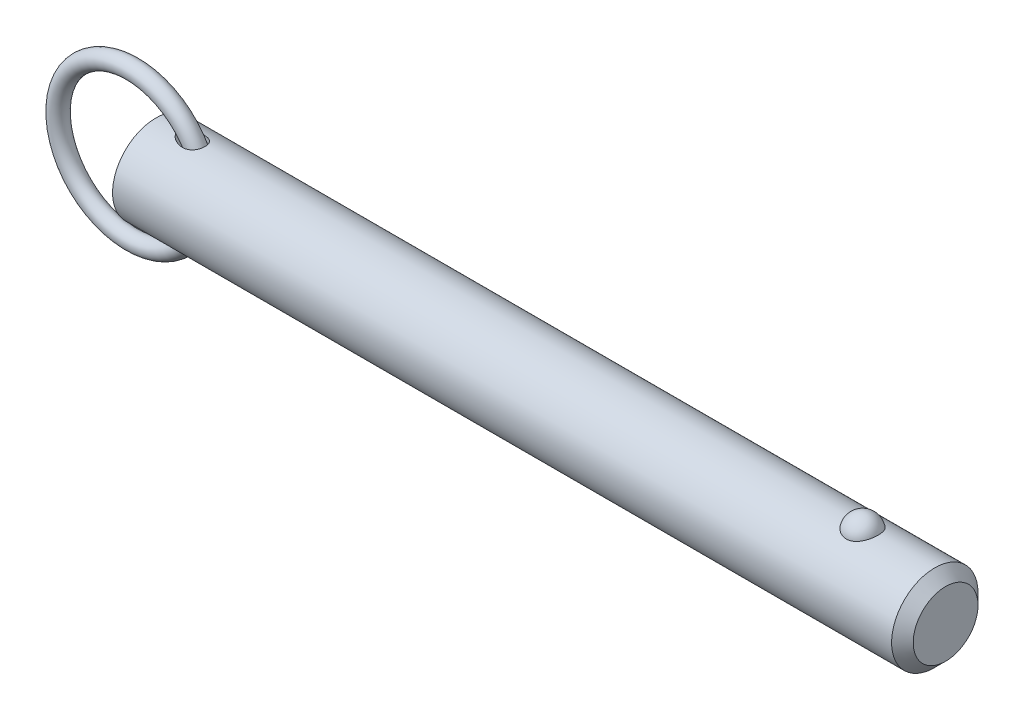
ISO-10303-21;
HEADER;
FILE_DESCRIPTION(('STEP AP214'),'2;1');
FILE_NAME('part.step','',(''),(''),'','','');
FILE_SCHEMA(('AUTOMOTIVE_DESIGN { 1 0 10303 214 1 1 1 1 }'));
ENDSEC;
DATA;
#1=APPLICATION_CONTEXT('core data for automotive mechanical design processes');
#2=APPLICATION_PROTOCOL_DEFINITION('international standard','automotive_design',2000,#1);
#3=PRODUCT_CONTEXT('',#1,'mechanical');
#4=PRODUCT('Part','Part','',(#3));
#5=PRODUCT_RELATED_PRODUCT_CATEGORY('part','',(#4));
#6=PRODUCT_DEFINITION_FORMATION('','',#4);
#7=PRODUCT_DEFINITION_CONTEXT('part definition',#1,'design');
#8=PRODUCT_DEFINITION('design','',#6,#7);
#9=PRODUCT_DEFINITION_SHAPE('','',#8);
#10=(LENGTH_UNIT() NAMED_UNIT(*) SI_UNIT(.MILLI.,.METRE.));
#11=(NAMED_UNIT(*) PLANE_ANGLE_UNIT() SI_UNIT($,.RADIAN.));
#12=(NAMED_UNIT(*) SI_UNIT($,.STERADIAN.) SOLID_ANGLE_UNIT());
#13=UNCERTAINTY_MEASURE_WITH_UNIT(LENGTH_MEASURE(1.E-05),#10,'distance_accuracy_value','');
#14=(GEOMETRIC_REPRESENTATION_CONTEXT(3) GLOBAL_UNCERTAINTY_ASSIGNED_CONTEXT((#13)) GLOBAL_UNIT_ASSIGNED_CONTEXT((#10,
#11,#12)) REPRESENTATION_CONTEXT('',''));
#15=CARTESIAN_POINT('',(0.,0.,0.));
#16=DIRECTION('',(0.,0.,1.));
#17=DIRECTION('',(1.,0.,0.));
#18=AXIS2_PLACEMENT_3D('',#15,#16,#17);
#19=CARTESIAN_POINT('',(-6.08699288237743,0.,0.));
#20=DIRECTION('',(0.,0.,1.));
#21=DIRECTION('',(1.,0.,0.));
#22=AXIS2_PLACEMENT_3D('',#19,#20,#21);
#23=TOROIDAL_SURFACE('',#22,19.05,2.223);
#24=CARTESIAN_POINT('',(15.1860071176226,0.,0.));
#25=VERTEX_POINT('',#24);
#26=VERTEX_LOOP('',#25);
#27=FACE_BOUND('',#26,.T.);
#28=ADVANCED_FACE('P0_F12',(#27),#23,.T.);
#29=CLOSED_SHELL('',(#28));
#30=MANIFOLD_SOLID_BREP('P0_B1',#29);
#31=CARTESIAN_POINT('',(0.,0.,0.));
#32=DIRECTION('',(1.,0.,0.));
#33=DIRECTION('',(0.,0.,-1.));
#34=AXIS2_PLACEMENT_3D('',#31,#32,#33);
#35=CYLINDRICAL_SURFACE('',#34,11.115);
#36=CARTESIAN_POINT('',(6.41405181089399,11.0227946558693,-1.4287136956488));
#37=CARTESIAN_POINT('',(6.49338916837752,11.0115377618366,-1.51556642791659));
#38=CARTESIAN_POINT('',(6.57765461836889,10.9998263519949,-1.59789397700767));
#39=CARTESIAN_POINT('',(6.75386647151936,10.9760304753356,-1.75391400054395));
#40=CARTESIAN_POINT('',(6.84582247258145,10.9639455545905,-1.82759540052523));
#41=CARTESIAN_POINT('',(7.03627827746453,10.9397989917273,-1.96698954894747));
#42=CARTESIAN_POINT('',(7.1348083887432,10.9277377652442,-2.03266078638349));
#43=CARTESIAN_POINT('',(7.33681032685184,10.9041015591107,-2.1558582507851));
#44=CARTESIAN_POINT('',(7.44028007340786,10.8925263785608,-2.21338786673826));
#45=CARTESIAN_POINT('',(7.64386117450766,10.8710104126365,-2.31666528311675));
#46=CARTESIAN_POINT('',(7.74368989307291,10.8610119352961,-2.36295942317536));
#47=CARTESIAN_POINT('',(7.94637195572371,10.8420168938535,-2.44863486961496));
#48=CARTESIAN_POINT('',(8.0492261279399,10.8330206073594,-2.48801426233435));
#49=CARTESIAN_POINT('',(8.36115573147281,10.807980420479,-2.59542730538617));
#50=CARTESIAN_POINT('',(8.57411849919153,10.7938278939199,-2.65299817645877));
#51=CARTESIAN_POINT('',(9.00825016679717,10.7725818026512,-2.73800108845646));
#52=CARTESIAN_POINT('',(9.22947335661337,10.7655491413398,-2.76517330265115));
#53=CARTESIAN_POINT('',(9.6736814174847,10.7605872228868,-2.78445308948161));
#54=CARTESIAN_POINT('',(9.89666486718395,10.7626512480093,-2.77658653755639));
#55=CARTESIAN_POINT('',(10.2950172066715,10.7754452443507,-2.72644436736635));
#56=CARTESIAN_POINT('',(10.4712789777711,10.7844280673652,-2.69109376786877));
#57=CARTESIAN_POINT('',(10.7292776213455,10.8024982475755,-2.61722365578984));
#58=CARTESIAN_POINT('',(10.8142337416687,10.8092901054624,-2.58911576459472));
#59=CARTESIAN_POINT('',(10.9813218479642,10.8242580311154,-2.52581287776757));
#60=CARTESIAN_POINT('',(11.0634550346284,10.8324335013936,-2.49062094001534));
#61=CARTESIAN_POINT('',(11.2247418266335,10.8500287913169,-2.41281958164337));
#62=CARTESIAN_POINT('',(11.3038694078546,10.8594572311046,-2.37015806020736));
#63=CARTESIAN_POINT('',(11.4576781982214,10.8792243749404,-2.27770403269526));
#64=CARTESIAN_POINT('',(11.5323615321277,10.8895626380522,-2.22791497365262));
#65=CARTESIAN_POINT('',(11.6765388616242,10.9108113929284,-2.12140590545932));
#66=CARTESIAN_POINT('',(11.7460329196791,10.9217218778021,-2.064685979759));
#67=CARTESIAN_POINT('',(11.8790597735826,10.9437207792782,-1.94471764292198));
#68=CARTESIAN_POINT('',(11.9425932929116,10.9548091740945,-1.88147002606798));
#69=CARTESIAN_POINT('',(12.109388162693,10.9851999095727,-1.69784918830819));
#70=CARTESIAN_POINT('',(12.205655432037,11.0042655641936,-1.57093023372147));
#71=CARTESIAN_POINT('',(12.374151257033,11.0393391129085,-1.3017676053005));
#72=CARTESIAN_POINT('',(12.4463875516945,11.0553479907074,-1.15952888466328));
#73=CARTESIAN_POINT('',(12.5615818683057,11.0816338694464,-0.871972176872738));
#74=CARTESIAN_POINT('',(12.6058896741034,11.0921698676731,-0.727217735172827));
#75=CARTESIAN_POINT('',(12.6699315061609,11.1075802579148,-0.43208997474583));
#76=CARTESIAN_POINT('',(12.6896681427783,11.1124552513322,-0.281717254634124));
#77=CARTESIAN_POINT('',(12.704022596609,11.1159901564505,0.0188164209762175));
#78=CARTESIAN_POINT('',(12.6988836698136,11.1147102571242,0.16896512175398));
#79=CARTESIAN_POINT('',(12.6641681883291,11.1062126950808,0.466238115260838));
#80=CARTESIAN_POINT('',(12.6345920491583,11.0989951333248,0.613362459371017));
#81=CARTESIAN_POINT('',(12.5517453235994,11.0794095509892,0.900330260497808));
#82=CARTESIAN_POINT('',(12.4984878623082,11.0670443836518,1.04017770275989));
#83=CARTESIAN_POINT('',(12.3696588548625,11.0385082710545,1.308745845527));
#84=CARTESIAN_POINT('',(12.2940887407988,11.0223375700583,1.43746725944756));
#85=CARTESIAN_POINT('',(12.122380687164,10.987872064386,1.68079704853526));
#86=CARTESIAN_POINT('',(12.0261637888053,10.969569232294,1.79534850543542));
#87=CARTESIAN_POINT('',(11.8161707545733,10.932836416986,2.00695695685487));
#88=CARTESIAN_POINT('',(11.7023941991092,10.9144064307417,2.10401353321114));
#89=CARTESIAN_POINT('',(11.4575656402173,10.8788057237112,2.28105326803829));
#90=CARTESIAN_POINT('',(11.3261451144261,10.8616794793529,2.36053412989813));
#91=CARTESIAN_POINT('',(11.0523589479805,10.8308019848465,2.49839044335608));
#92=CARTESIAN_POINT('',(10.9099908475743,10.8170514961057,2.55676113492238));
#93=CARTESIAN_POINT('',(10.6060622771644,10.7929728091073,2.65666105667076));
#94=CARTESIAN_POINT('',(10.4438877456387,10.7830209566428,2.69640163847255));
#95=CARTESIAN_POINT('',(10.1154037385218,10.7687230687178,2.75293129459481));
#96=CARTESIAN_POINT('',(9.94909141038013,10.7643810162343,2.76970406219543));
#97=CARTESIAN_POINT('',(9.54387061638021,10.7604809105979,2.7848723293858));
#98=CARTESIAN_POINT('',(9.30446860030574,10.7637793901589,2.7722775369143));
#99=CARTESIAN_POINT('',(8.94961255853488,10.7757341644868,2.72524141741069));
#100=CARTESIAN_POINT('',(8.83186896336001,10.7808994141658,2.70482239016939));
#101=CARTESIAN_POINT('',(8.59835142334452,10.7932548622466,2.65509992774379));
#102=CARTESIAN_POINT('',(8.48257728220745,10.8004448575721,2.62579738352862));
#103=CARTESIAN_POINT('',(8.25208469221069,10.8166382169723,2.55827624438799));
#104=CARTESIAN_POINT('',(8.13740214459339,10.8256649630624,2.51994155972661));
#105=CARTESIAN_POINT('',(7.91132058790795,10.8451170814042,2.43486475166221));
#106=CARTESIAN_POINT('',(7.79992154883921,10.8555424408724,2.38812270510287));
#107=CARTESIAN_POINT('',(7.58115677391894,10.8774251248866,2.28638483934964));
#108=CARTESIAN_POINT('',(7.47378802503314,10.8888816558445,2.23139534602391));
#109=CARTESIAN_POINT('',(7.26385624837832,10.9124540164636,2.11310265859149));
#110=CARTESIAN_POINT('',(7.16129168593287,10.9245696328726,2.04980214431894));
#111=CARTESIAN_POINT('',(6.91882218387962,10.9543689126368,1.88540538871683));
#112=CARTESIAN_POINT('',(6.7819377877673,10.9721958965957,1.77979827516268));
#113=CARTESIAN_POINT('',(6.52472441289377,11.0070222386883,1.5498969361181));
#114=CARTESIAN_POINT('',(6.40436902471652,11.0240228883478,1.42563320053));
#115=CARTESIAN_POINT('',(6.2183880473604,11.0509658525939,1.19529359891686));
#116=CARTESIAN_POINT('',(6.14691885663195,11.0615430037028,1.09404520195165));
#117=CARTESIAN_POINT('',(6.02043496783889,11.0805004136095,0.881508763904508));
#118=CARTESIAN_POINT('',(5.96539400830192,11.0888841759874,0.7702371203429));
#119=CARTESIAN_POINT('',(5.88475453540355,11.1012553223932,0.560577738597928));
#120=CARTESIAN_POINT('',(5.85559643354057,11.1057686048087,0.463603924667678));
#121=CARTESIAN_POINT('',(5.81381299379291,11.1122523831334,0.266083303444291));
#122=CARTESIAN_POINT('',(5.80117118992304,11.1142254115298,0.165540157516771));
#123=CARTESIAN_POINT('',(5.79363815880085,11.1153999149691,-0.0364747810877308));
#124=CARTESIAN_POINT('',(5.79878799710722,11.1145949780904,-0.137948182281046));
#125=CARTESIAN_POINT('',(5.82639592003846,11.1102987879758,-0.338493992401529));
#126=CARTESIAN_POINT('',(5.8488723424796,11.1068046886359,-0.437563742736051));
#127=CARTESIAN_POINT('',(5.91510741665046,11.0965857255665,-0.649968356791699));
#128=CARTESIAN_POINT('',(5.96220905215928,11.0893566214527,-0.762222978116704));
#129=CARTESIAN_POINT('',(6.07378449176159,11.072471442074,-0.977396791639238));
#130=CARTESIAN_POINT('',(6.13826787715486,11.0628140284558,-1.08031079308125));
#131=CARTESIAN_POINT('',(6.24101077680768,11.0477136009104,-1.2219580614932));
#132=CARTESIAN_POINT('',(6.27403486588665,11.042895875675,-1.26469183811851));
#133=CARTESIAN_POINT('',(6.3423802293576,11.0330152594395,-1.34817011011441));
#134=CARTESIAN_POINT('',(6.37769867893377,11.0279526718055,-1.38891694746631));
#135=CARTESIAN_POINT('',(6.41405181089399,11.0227946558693,-1.4287136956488));
#136=B_SPLINE_CURVE_WITH_KNOTS('',3,(#36,#37,#38,#39,#40,#41,#42,#43,#44,#45,#46,#47,#48,#49,
#50,#51,#52,#53,#54,#55,#56,#57,#58,#59,#60,#61,#62,#63,#64,#65,#66,#67,#68,#69,#70,#71,#72,#73,
#74,#75,#76,#77,#78,#79,#80,#81,#82,#83,#84,#85,#86,#87,#88,#89,#90,#91,#92,#93,#94,#95,#96,#97,
#98,#99,#100,#101,#102,#103,#104,#105,#106,#107,#108,#109,#110,#111,#112,#113,#114,#115,#116,
#117,#118,#119,#120,#121,#122,#123,#124,#125,#126,#127,#128,#129,#130,#131,#132,#133,#134,#135),
.UNSPECIFIED.,.T.,.F.,(4,2,2,2,2,2,2,2,2,2,2,2,2,2,2,2,2,2,2,2,2,2,2,2,2,2,2,2,2,2,2,2,2,2,2,2,
2,2,2,2,2,2,2,2,2,2,2,2,2,4),(0.,0.354433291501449,0.709315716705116,1.0659654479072,
1.42246628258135,1.7536715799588,2.08496839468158,2.74582009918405,3.41227815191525,
4.07824412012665,4.61583787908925,4.88478112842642,5.1536085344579,5.42439170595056,
5.69504436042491,5.96569375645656,6.23631025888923,6.7149072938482,7.1933500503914,
7.6464143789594,8.09943057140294,8.54802575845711,8.99661331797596,9.44495256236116,
9.89326303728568,10.3433195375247,10.7933867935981,11.2550086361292,11.7167345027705,
12.2165866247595,12.7167934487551,13.4318876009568,13.7904664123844,14.1490092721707,
14.5124394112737,14.8758662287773,15.239015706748,15.6020483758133,16.1219860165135,
16.6410830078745,17.0130520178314,17.3844231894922,17.6872330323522,17.9897407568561,
18.2929471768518,18.5964749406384,18.9603532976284,19.3244326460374,19.4870338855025,
19.649438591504),.UNSPECIFIED.);
#137=CARTESIAN_POINT('',(6.41405181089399,11.0227946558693,-1.4287136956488));
#138=VERTEX_POINT('',#137);
#139=EDGE_CURVE('P1_E40',#138,#138,#136,.T.);
#140=ORIENTED_EDGE('',*,*,#139,.T.);
#141=EDGE_LOOP('',(#140));
#142=FACE_BOUND('',#141,.T.);
#143=CARTESIAN_POINT('',(200.42125,0.,0.));
#144=DIRECTION('',(1.,0.,0.));
#145=DIRECTION('',(0.,0.,-1.));
#146=AXIS2_PLACEMENT_3D('',#143,#144,#145);
#147=CIRCLE('',#146,11.115);
#148=CARTESIAN_POINT('',(200.42125,0.,-11.115));
#149=VERTEX_POINT('',#148);
#150=EDGE_CURVE('P1_E25',#149,#149,#147,.T.);
#151=ORIENTED_EDGE('',*,*,#150,.F.);
#152=EDGE_LOOP('',(#151));
#153=FACE_BOUND('',#152,.T.);
#154=CARTESIAN_POINT('',(0.,0.,0.));
#155=DIRECTION('',(1.,0.,0.));
#156=DIRECTION('',(0.,0.,-1.));
#157=AXIS2_PLACEMENT_3D('',#154,#155,#156);
#158=CIRCLE('',#157,11.115);
#159=CARTESIAN_POINT('',(0.,0.,-11.115));
#160=VERTEX_POINT('',#159);
#161=EDGE_CURVE('P1_E9',#160,#160,#158,.T.);
#162=ORIENTED_EDGE('',*,*,#161,.T.);
#163=EDGE_LOOP('',(#162));
#164=FACE_BOUND('',#163,.T.);
#165=CARTESIAN_POINT('',(181.831068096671,10.3028087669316,4.17077409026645));
#166=CARTESIAN_POINT('',(181.614775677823,10.3028003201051,4.17078240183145));
#167=CARTESIAN_POINT('',(181.398548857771,10.3098895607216,4.15340593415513));
#168=CARTESIAN_POINT('',(180.972540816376,10.3373834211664,4.08449540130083));
#169=CARTESIAN_POINT('',(180.762757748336,10.3577841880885,4.0329712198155));
#170=CARTESIAN_POINT('',(180.355782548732,10.4095237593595,3.89746513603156));
#171=CARTESIAN_POINT('',(180.158572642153,10.4408466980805,3.81353029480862));
#172=CARTESIAN_POINT('',(179.781338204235,10.5110236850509,3.61560339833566));
#173=CARTESIAN_POINT('',(179.601317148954,10.5498792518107,3.50160528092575));
#174=CARTESIAN_POINT('',(179.257684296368,10.6322884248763,3.24292464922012));
#175=CARTESIAN_POINT('',(179.094686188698,10.6759443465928,3.0974604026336));
#176=CARTESIAN_POINT('',(178.794591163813,10.7625291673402,2.78171925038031));
#177=CARTESIAN_POINT('',(178.657499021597,10.8054579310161,2.61143778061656));
#178=CARTESIAN_POINT('',(178.406408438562,10.8881935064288,2.24226695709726));
#179=CARTESIAN_POINT('',(178.293710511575,10.9277761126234,2.04244123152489));
#180=CARTESIAN_POINT('',(178.101777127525,10.997484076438,1.62578254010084));
#181=CARTESIAN_POINT('',(178.022544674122,11.0276085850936,1.40894804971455));
#182=CARTESIAN_POINT('',(177.898303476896,11.0756732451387,0.961250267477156));
#183=CARTESIAN_POINT('',(177.853760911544,11.0934470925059,0.730239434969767));
#184=CARTESIAN_POINT('',(177.801569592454,11.1143331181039,0.26343964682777));
#185=CARTESIAN_POINT('',(177.793920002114,11.1174456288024,0.0276507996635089));
#186=CARTESIAN_POINT('',(177.81561056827,11.1087161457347,-0.440729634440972));
#187=CARTESIAN_POINT('',(177.844762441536,11.0969502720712,-0.6733313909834));
#188=CARTESIAN_POINT('',(177.939143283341,11.0597872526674,-1.12996621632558));
#189=CARTESIAN_POINT('',(178.004372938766,11.0343898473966,-1.35399912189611));
#190=CARTESIAN_POINT('',(178.16969844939,10.972515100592,-1.78750286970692));
#191=CARTESIAN_POINT('',(178.26983863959,10.9360236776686,-1.99695478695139));
#192=CARTESIAN_POINT('',(178.502940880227,10.8557595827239,-2.3952066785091));
#193=CARTESIAN_POINT('',(178.635905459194,10.8119863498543,-2.5840050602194));
#194=CARTESIAN_POINT('',(178.932407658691,10.7216733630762,-2.93635726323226));
#195=CARTESIAN_POINT('',(179.096056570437,10.675123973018,-3.09981510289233));
#196=CARTESIAN_POINT('',(179.449860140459,10.5846571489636,-3.39592247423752));
#197=CARTESIAN_POINT('',(179.640012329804,10.5407394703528,-3.52857487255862));
#198=CARTESIAN_POINT('',(180.03750141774,10.4616690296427,-3.75646057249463));
#199=CARTESIAN_POINT('',(180.24436705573,10.4263443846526,-3.85245432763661));
#200=CARTESIAN_POINT('',(180.672954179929,10.3675574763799,-4.00798747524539));
#201=CARTESIAN_POINT('',(180.894670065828,10.344090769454,-4.0675405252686));
#202=CARTESIAN_POINT('',(181.334669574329,10.3128282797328,-4.14614314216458));
#203=CARTESIAN_POINT('',(181.552565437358,10.3043040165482,-4.1670783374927));
#204=CARTESIAN_POINT('',(181.98894951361,10.3016771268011,-4.17357158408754));
#205=CARTESIAN_POINT('',(182.207437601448,10.3075716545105,-4.15913661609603));
#206=CARTESIAN_POINT('',(182.631744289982,10.3326686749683,-4.09636961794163));
#207=CARTESIAN_POINT('',(182.837745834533,10.3514555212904,-4.0490957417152));
#208=CARTESIAN_POINT('',(183.238576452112,10.399818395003,-3.92320197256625));
#209=CARTESIAN_POINT('',(183.4334046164,10.4293952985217,-3.84457953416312));
#210=CARTESIAN_POINT('',(183.811191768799,10.4969600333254,-3.65612410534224));
#211=CARTESIAN_POINT('',(183.993797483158,10.5351178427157,-3.54564545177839));
#212=CARTESIAN_POINT('',(184.338204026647,10.6154999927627,-3.29718036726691));
#213=CARTESIAN_POINT('',(184.500000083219,10.657725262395,-3.15918764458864));
#214=CARTESIAN_POINT('',(184.806959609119,10.744212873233,-2.85163580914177));
#215=CARTESIAN_POINT('',(184.950891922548,10.7884718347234,-2.68084605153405));
#216=CARTESIAN_POINT('',(185.209237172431,10.872374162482,-2.31721864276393));
#217=CARTESIAN_POINT('',(185.323644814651,10.9120167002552,-2.12437704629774));
#218=CARTESIAN_POINT('',(185.523873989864,10.9838919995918,-1.71516999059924));
#219=CARTESIAN_POINT('',(185.60866178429,11.0158465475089,-1.49824866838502));
#220=CARTESIAN_POINT('',(185.74268382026,11.0673523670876,-1.05228572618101));
#221=CARTESIAN_POINT('',(185.791917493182,11.086903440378,-0.823243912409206));
#222=CARTESIAN_POINT('',(185.853891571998,11.1116323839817,-0.359087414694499));
#223=CARTESIAN_POINT('',(185.866566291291,11.1167843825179,-0.123962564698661));
#224=CARTESIAN_POINT('',(185.854973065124,11.1121144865,0.345220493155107));
#225=CARTESIAN_POINT('',(185.830705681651,11.1022928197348,0.57927871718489));
#226=CARTESIAN_POINT('',(185.745907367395,11.0687504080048,1.03866534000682));
#227=CARTESIAN_POINT('',(185.685529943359,11.0450885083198,1.26402641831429));
#228=CARTESIAN_POINT('',(185.529853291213,10.9863185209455,1.70076772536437));
#229=CARTESIAN_POINT('',(185.434551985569,10.9512097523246,1.91214712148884));
#230=CARTESIAN_POINT('',(185.210397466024,10.8729733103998,2.316083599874));
#231=CARTESIAN_POINT('',(185.081380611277,10.8298068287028,2.50854240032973));
#232=CARTESIAN_POINT('',(184.792732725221,10.7401896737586,2.86808766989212));
#233=CARTESIAN_POINT('',(184.633102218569,10.6937390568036,3.03517457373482));
#234=CARTESIAN_POINT('',(184.287534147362,10.6029321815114,3.33857581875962));
#235=CARTESIAN_POINT('',(184.101708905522,10.5585680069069,3.47501541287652));
#236=CARTESIAN_POINT('',(183.707875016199,10.4769321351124,3.71390897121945));
#237=CARTESIAN_POINT('',(183.499863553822,10.439661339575,3.81635861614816));
#238=CARTESIAN_POINT('',(183.054066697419,10.3749407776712,3.98910631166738));
#239=CARTESIAN_POINT('',(182.815234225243,10.3482457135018,4.05700929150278));
#240=CARTESIAN_POINT('',(182.327925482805,10.312188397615,4.14782844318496));
#241=CARTESIAN_POINT('',(182.079453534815,10.3028184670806,4.17076454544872));
#242=CARTESIAN_POINT('',(181.831068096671,10.3028087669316,4.17077409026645));
#243=B_SPLINE_CURVE_WITH_KNOTS('',3,(#165,#166,#167,#168,#169,#170,#171,#172,#173,#174,#175,
#176,#177,#178,#179,#180,#181,#182,#183,#184,#185,#186,#187,#188,#189,#190,#191,#192,#193,#194,
#195,#196,#197,#198,#199,#200,#201,#202,#203,#204,#205,#206,#207,#208,#209,#210,#211,#212,#213,
#214,#215,#216,#217,#218,#219,#220,#221,#222,#223,#224,#225,#226,#227,#228,#229,#230,#231,#232,
#233,#234,#235,#236,#237,#238,#239,#240,#241,#242),.UNSPECIFIED.,.T.,.F.,(4,2,2,2,2,2,2,2,2,2,2,
2,2,2,2,2,2,2,2,2,2,2,2,2,2,2,2,2,2,2,2,2,2,2,2,2,2,2,4),(0.,0.64796614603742,1.29574482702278,
1.9425864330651,2.58955857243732,3.25496465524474,3.92049326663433,4.61566368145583,
5.31089647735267,6.01531821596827,6.71972398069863,7.42054043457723,8.12137023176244,
8.82309331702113,9.5248704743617,10.2292439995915,10.9335519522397,11.6223330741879,
12.3108558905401,12.9647664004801,13.6185478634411,14.252184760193,14.8858731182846,
15.5334360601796,16.1811472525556,16.8611459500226,17.5412664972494,18.2431855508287,
18.9451158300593,19.6483065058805,20.3514864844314,21.0516982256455,21.7519516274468,
22.4556690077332,23.1593743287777,23.860149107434,24.5610129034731,25.3054529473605,
26.049562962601),.UNSPECIFIED.);
#244=CARTESIAN_POINT('',(181.831068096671,10.3028087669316,4.17077409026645));
#245=VERTEX_POINT('',#244);
#246=EDGE_CURVE('P1_E34',#245,#245,#243,.T.);
#247=ORIENTED_EDGE('',*,*,#246,.T.);
#248=EDGE_LOOP('',(#247));
#249=FACE_BOUND('',#248,.T.);
#250=CARTESIAN_POINT('',(6.41405181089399,-11.0227946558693,-1.4287136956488));
#251=CARTESIAN_POINT('',(6.33124061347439,-11.0345445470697,-1.33806125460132));
#252=CARTESIAN_POINT('',(6.25372866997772,-11.0458090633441,-1.24240732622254));
#253=CARTESIAN_POINT('',(6.11277905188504,-11.0666115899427,-1.04095704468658));
#254=CARTESIAN_POINT('',(6.04933920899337,-11.0761498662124,-0.935162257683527));
#255=CARTESIAN_POINT('',(5.94029181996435,-11.0927063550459,-0.712476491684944));
#256=CARTESIAN_POINT('',(5.89492964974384,-11.0996897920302,-0.595457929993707));
#257=CARTESIAN_POINT('',(5.84498161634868,-11.1074141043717,-0.414997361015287));
#258=CARTESIAN_POINT('',(5.83135004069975,-11.1095300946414,-0.354047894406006));
#259=CARTESIAN_POINT('',(5.81051649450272,-11.1127688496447,-0.231041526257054));
#260=CARTESIAN_POINT('',(5.80331311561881,-11.1138918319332,-0.168984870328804));
#261=CARTESIAN_POINT('',(5.79296529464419,-11.1155042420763,-0.000484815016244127));
#262=CARTESIAN_POINT('',(5.79625267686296,-11.1149904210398,0.106437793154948));
#263=CARTESIAN_POINT('',(5.82213676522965,-11.1109609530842,0.317809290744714));
#264=CARTESIAN_POINT('',(5.84474662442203,-11.1074432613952,0.42225644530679));
#265=CARTESIAN_POINT('',(5.911131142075,-11.097197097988,0.639361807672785));
#266=CARTESIAN_POINT('',(5.95733120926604,-11.090102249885,0.751250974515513));
#267=CARTESIAN_POINT('',(6.06709542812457,-11.0734770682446,0.965912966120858));
#268=CARTESIAN_POINT('',(6.13068735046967,-11.06394284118,1.06867085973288));
#269=CARTESIAN_POINT('',(6.30294237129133,-11.0385920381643,1.30890635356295));
#270=CARTESIAN_POINT('',(6.41896200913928,-11.0218881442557,1.44097376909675));
#271=CARTESIAN_POINT('',(6.6698965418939,-10.9871512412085,1.68553954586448));
#272=CARTESIAN_POINT('',(6.80485520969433,-10.9691152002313,1.79799117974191));
#273=CARTESIAN_POINT('',(7.04881236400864,-10.9382283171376,1.97587596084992));
#274=CARTESIAN_POINT('',(7.15465712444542,-10.9253240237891,2.04570822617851));
#275=CARTESIAN_POINT('',(7.37202504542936,-10.9000987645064,2.17611840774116));
#276=CARTESIAN_POINT('',(7.48355057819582,-10.8877780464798,2.23669241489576));
#277=CARTESIAN_POINT('',(7.71132418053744,-10.8641580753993,2.34873831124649));
#278=CARTESIAN_POINT('',(7.82757727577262,-10.8528599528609,2.40020018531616));
#279=CARTESIAN_POINT('',(8.06386825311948,-10.8317234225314,2.49385169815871));
#280=CARTESIAN_POINT('',(8.18390558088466,-10.8218848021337,2.53604268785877));
#281=CARTESIAN_POINT('',(8.42918336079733,-10.8039208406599,2.61152283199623));
#282=CARTESIAN_POINT('',(8.55447802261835,-10.7958283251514,2.64464414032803));
#283=CARTESIAN_POINT('',(8.80752127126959,-10.781995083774,2.70048793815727));
#284=CARTESIAN_POINT('',(8.93527019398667,-10.7762546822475,2.72320899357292));
#285=CARTESIAN_POINT('',(9.1921017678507,-10.7675291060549,2.75750994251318));
#286=CARTESIAN_POINT('',(9.32118105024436,-10.7645381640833,2.76911315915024));
#287=CARTESIAN_POINT('',(9.57984338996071,-10.761622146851,2.78042035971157));
#288=CARTESIAN_POINT('',(9.70942621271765,-10.7616957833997,2.78012934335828));
#289=CARTESIAN_POINT('',(10.0243125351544,-10.7659059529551,2.76381534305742));
#290=CARTESIAN_POINT('',(10.209307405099,-10.7717977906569,2.74099674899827));
#291=CARTESIAN_POINT('',(10.5731188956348,-10.7905408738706,2.66626238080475));
#292=CARTESIAN_POINT('',(10.7519389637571,-10.8033881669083,2.61436313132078));
#293=CARTESIAN_POINT('',(11.0114289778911,-10.8271584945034,2.51336808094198));
#294=CARTESIAN_POINT('',(11.096831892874,-10.835881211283,2.47562331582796));
#295=CARTESIAN_POINT('',(11.2636000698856,-10.8545688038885,2.39236170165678));
#296=CARTESIAN_POINT('',(11.3449673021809,-10.8645330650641,2.3468486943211));
#297=CARTESIAN_POINT('',(11.5027832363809,-10.8853818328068,2.24815967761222));
#298=CARTESIAN_POINT('',(11.5792327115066,-10.8962661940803,2.19498487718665));
#299=CARTESIAN_POINT('',(11.7263315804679,-10.9185541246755,2.08128855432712));
#300=CARTESIAN_POINT('',(11.7969818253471,-10.9299576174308,2.02076811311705));
#301=CARTESIAN_POINT('',(11.9817953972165,-10.9613645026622,1.84513663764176));
#302=CARTESIAN_POINT('',(12.0893012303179,-10.9814643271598,1.72286660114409));
#303=CARTESIAN_POINT('',(12.2803576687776,-11.0193991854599,1.46066991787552));
#304=CARTESIAN_POINT('',(12.3639173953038,-11.0372350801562,1.3207500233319));
#305=CARTESIAN_POINT('',(12.4996220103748,-11.0672969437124,1.03778067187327));
#306=CARTESIAN_POINT('',(12.5535315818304,-11.0798242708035,0.895607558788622));
#307=CARTESIAN_POINT('',(12.636874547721,-11.0995427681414,0.603918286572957));
#308=CARTESIAN_POINT('',(12.6663115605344,-11.1067347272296,0.454403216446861));
#309=CARTESIAN_POINT('',(12.6997387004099,-11.1149224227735,0.154577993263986));
#310=CARTESIAN_POINT('',(12.7040886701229,-11.1160057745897,0.00431019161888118));
#311=CARTESIAN_POINT('',(12.6882048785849,-11.1120956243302,-0.294841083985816));
#312=CARTESIAN_POINT('',(12.6679715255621,-11.1071022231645,-0.443724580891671));
#313=CARTESIAN_POINT('',(12.6034470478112,-11.0915888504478,-0.735688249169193));
#314=CARTESIAN_POINT('',(12.5591858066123,-11.0810757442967,-0.878775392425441));
#315=CARTESIAN_POINT('',(12.4477416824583,-11.0556687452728,-1.15529525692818));
#316=CARTESIAN_POINT('',(12.3805601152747,-11.0407751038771,-1.28872853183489));
#317=CARTESIAN_POINT('',(12.2248919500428,-11.0081839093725,-1.54257976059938));
#318=CARTESIAN_POINT('',(12.1363549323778,-10.9904797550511,-1.66296592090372));
#319=CARTESIAN_POINT('',(11.9406137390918,-10.9541951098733,-1.88726577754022));
#320=CARTESIAN_POINT('',(11.833409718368,-10.9356146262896,-1.9911796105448));
#321=CARTESIAN_POINT('',(11.601318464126,-10.8991360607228,-2.18213646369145));
#322=CARTESIAN_POINT('',(11.4761325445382,-10.8812577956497,-2.26881927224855));
#323=CARTESIAN_POINT('',(11.2134852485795,-10.8482871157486,-2.42157282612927));
#324=CARTESIAN_POINT('',(11.0760218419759,-10.8331951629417,-2.48764015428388));
#325=CARTESIAN_POINT('',(10.7828968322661,-10.8061050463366,-2.60290068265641));
#326=CARTESIAN_POINT('',(10.6266338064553,-10.7943907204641,-2.65062248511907));
#327=CARTESIAN_POINT('',(10.3086617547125,-10.7762429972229,-2.72345054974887));
#328=CARTESIAN_POINT('',(10.146948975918,-10.7698133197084,-2.74854088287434));
#329=CARTESIAN_POINT('',(9.75541304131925,-10.7608036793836,-2.78368719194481));
#330=CARTESIAN_POINT('',(9.52459435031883,-10.7608467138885,-2.78350276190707));
#331=CARTESIAN_POINT('',(9.0660496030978,-10.7702674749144,-2.74677945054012));
#332=CARTESIAN_POINT('',(8.83832966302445,-10.7796615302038,-2.71017697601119));
#333=CARTESIAN_POINT('',(8.38783466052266,-10.8058248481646,-2.60392490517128));
#334=CARTESIAN_POINT('',(8.16517101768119,-10.8226939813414,-2.53382676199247));
#335=CARTESIAN_POINT('',(7.84087311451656,-10.8516548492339,-2.40555545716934));
#336=CARTESIAN_POINT('',(7.73435551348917,-10.8619221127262,-2.35892455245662));
#337=CARTESIAN_POINT('',(7.52510420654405,-10.883357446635,-2.25797017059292));
#338=CARTESIAN_POINT('',(7.42236986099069,-10.8945253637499,-2.20364800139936));
#339=CARTESIAN_POINT('',(7.23808758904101,-10.915528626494,-2.09688018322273));
#340=CARTESIAN_POINT('',(7.15584631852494,-10.9252787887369,-2.0456107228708));
#341=CARTESIAN_POINT('',(6.99510576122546,-10.944960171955,-1.93754729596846));
#342=CARTESIAN_POINT('',(6.91660574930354,-10.9548913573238,-1.88075440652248));
#343=CARTESIAN_POINT('',(6.76418133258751,-10.974690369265,-1.76154504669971));
#344=CARTESIAN_POINT('',(6.69024940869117,-10.9845582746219,-1.6991382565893));
#345=CARTESIAN_POINT('',(6.54780119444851,-11.0039826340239,-1.56842485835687));
#346=CARTESIAN_POINT('',(6.47928247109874,-11.0135392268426,-1.50012092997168));
#347=CARTESIAN_POINT('',(6.41405181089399,-11.0227946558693,-1.4287136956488));
#348=B_SPLINE_CURVE_WITH_KNOTS('',3,(#250,#251,#252,#253,#254,#255,#256,#257,#258,#259,#260,
#261,#262,#263,#264,#265,#266,#267,#268,#269,#270,#271,#272,#273,#274,#275,#276,#277,#278,#279,
#280,#281,#282,#283,#284,#285,#286,#287,#288,#289,#290,#291,#292,#293,#294,#295,#296,#297,#298,
#299,#300,#301,#302,#303,#304,#305,#306,#307,#308,#309,#310,#311,#312,#313,#314,#315,#316,#317,
#318,#319,#320,#321,#322,#323,#324,#325,#326,#327,#328,#329,#330,#331,#332,#333,#334,#335,#336,
#337,#338,#339,#340,#341,#342,#343,#344,#345,#346,#347),.UNSPECIFIED.,.T.,.F.,(4,2,2,2,2,2,2,2,
2,2,2,2,2,2,2,2,2,2,2,2,2,2,2,2,2,2,2,2,2,2,2,2,2,2,2,2,2,2,2,2,2,2,2,2,2,2,2,2,4),(0.,
0.369835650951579,0.739614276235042,1.11425380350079,1.30141910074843,1.48854338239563,
1.80745879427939,2.12659146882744,2.48838884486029,2.85076733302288,3.3776216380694,
3.9057143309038,4.287639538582,4.66972556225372,5.05222896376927,5.43467659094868,
5.82378546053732,6.21294796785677,6.6012922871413,6.98947336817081,7.54669558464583,
8.10360148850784,8.38458539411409,8.66543074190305,8.94623182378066,9.22699162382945,
9.71628887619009,10.2053995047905,10.6608871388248,11.1163074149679,11.5651786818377,
12.0140424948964,12.4623493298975,12.9106304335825,13.3599804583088,13.8093267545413,
14.2672570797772,14.7252632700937,15.214740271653,15.7045615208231,16.3932594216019,
17.083162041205,17.7825738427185,18.1325177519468,18.4824022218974,18.7744056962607,
19.0663523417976,19.3578048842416,19.6491256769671),.UNSPECIFIED.);
#349=CARTESIAN_POINT('',(6.41405181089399,-11.0227946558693,-1.4287136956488));
#350=VERTEX_POINT('',#349);
#351=EDGE_CURVE('P1_E17',#350,#350,#348,.T.);
#352=ORIENTED_EDGE('',*,*,#351,.T.);
#353=EDGE_LOOP('',(#352));
#354=FACE_BOUND('',#353,.T.);
#355=ADVANCED_FACE('P1_F13',(#142,#153,#164,#249,#354),#35,.T.);
#356=CARTESIAN_POINT('',(0.,0.,0.));
#357=DIRECTION('',(-1.,0.,0.));
#358=DIRECTION('',(0.,0.,1.));
#359=AXIS2_PLACEMENT_3D('',#356,#357,#358);
#360=PLANE('',#359);
#361=ORIENTED_EDGE('',*,*,#161,.F.);
#362=EDGE_LOOP('',(#361));
#363=FACE_BOUND('',#362,.T.);
#364=ADVANCED_FACE('P1_F15',(#363),#360,.T.);
#365=CARTESIAN_POINT('',(203.2,0.,0.));
#366=DIRECTION('',(-1.,0.,0.));
#367=DIRECTION('',(0.,0.,1.));
#368=AXIS2_PLACEMENT_3D('',#365,#366,#367);
#369=CONICAL_SURFACE('',#368,8.33625000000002,0.78539816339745);
#370=ORIENTED_EDGE('',*,*,#150,.T.);
#371=EDGE_LOOP('',(#370));
#372=FACE_BOUND('',#371,.T.);
#373=CARTESIAN_POINT('',(203.2,0.,0.));
#374=DIRECTION('',(1.,0.,0.));
#375=DIRECTION('',(0.,0.,-1.));
#376=AXIS2_PLACEMENT_3D('',#373,#374,#375);
#377=CIRCLE('',#376,8.33625000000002);
#378=CARTESIAN_POINT('',(203.2,0.,-8.33625000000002));
#379=VERTEX_POINT('',#378);
#380=EDGE_CURVE('P1_E30',#379,#379,#377,.T.);
#381=ORIENTED_EDGE('',*,*,#380,.F.);
#382=EDGE_LOOP('',(#381));
#383=FACE_BOUND('',#382,.T.);
#384=ADVANCED_FACE('P1_F55',(#372,#383),#369,.T.);
#385=CARTESIAN_POINT('',(203.2,8.33625000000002,0.));
#386=DIRECTION('',(1.,0.,0.));
#387=DIRECTION('',(0.,0.,-1.));
#388=AXIS2_PLACEMENT_3D('',#385,#386,#387);
#389=PLANE('',#388);
#390=ORIENTED_EDGE('',*,*,#380,.T.);
#391=EDGE_LOOP('',(#390));
#392=FACE_BOUND('',#391,.T.);
#393=ADVANCED_FACE('P1_F51',(#392),#389,.T.);
#394=CARTESIAN_POINT('',(181.831068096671,10.0035,0.));
#395=DIRECTION('',(-1.,0.,0.));
#396=DIRECTION('',(0.,1.,0.));
#397=AXIS2_PLACEMENT_3D('',#394,#395,#396);
#398=SPHERICAL_SURFACE('',#397,4.18150000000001);
#399=ORIENTED_EDGE('',*,*,#246,.F.);
#400=EDGE_LOOP('',(#399));
#401=FACE_BOUND('',#400,.T.);
#402=ADVANCED_FACE('P1_F46',(#401),#398,.T.);
#403=CARTESIAN_POINT('',(-6.08699288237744,0.,0.));
#404=DIRECTION('',(0.,0.,1.));
#405=DIRECTION('',(1.,0.,0.));
#406=AXIS2_PLACEMENT_3D('',#403,#404,#405);
#407=TOROIDAL_SURFACE('',#406,19.05,2.77875);
#408=ORIENTED_EDGE('',*,*,#351,.F.);
#409=EDGE_LOOP('',(#408));
#410=FACE_BOUND('',#409,.T.);
#411=ORIENTED_EDGE('',*,*,#139,.F.);
#412=EDGE_LOOP('',(#411));
#413=FACE_BOUND('',#412,.T.);
#414=ADVANCED_FACE('P1_F50',(#410,#413),#407,.F.);
#415=CLOSED_SHELL('',(#355,#364,#384,#393,#402,#414));
#416=MANIFOLD_SOLID_BREP('P1_B1',#415);
#417=ADVANCED_BREP_SHAPE_REPRESENTATION('',(#18,#30,#416),#14);
#418=SHAPE_DEFINITION_REPRESENTATION(#9,#417);
ENDSEC;
END-ISO-10303-21;
